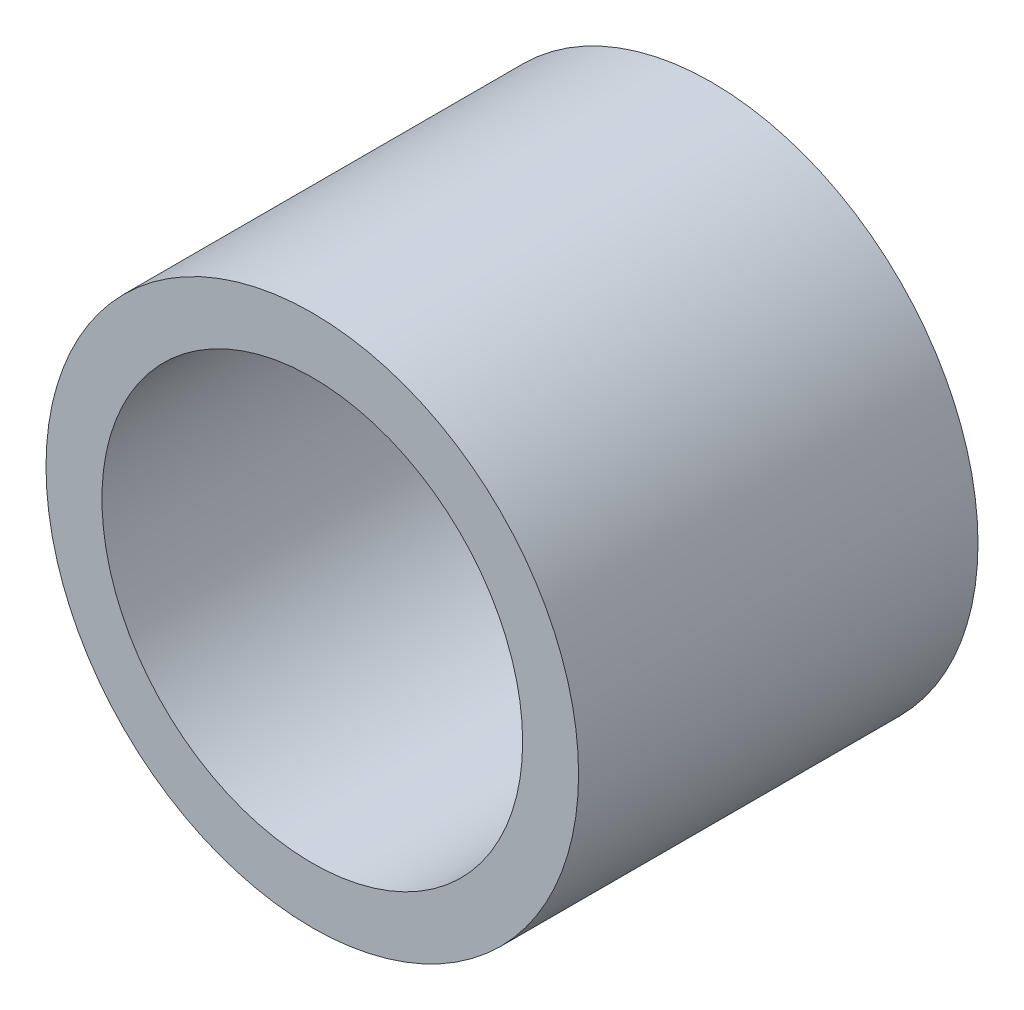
ISO-10303-21;
HEADER;
FILE_DESCRIPTION(('STEP AP214'),'2;1');
FILE_NAME('part.step','',(''),(''),'','','');
FILE_SCHEMA(('AUTOMOTIVE_DESIGN { 1 0 10303 214 1 1 1 1 }'));
ENDSEC;
DATA;
#1=APPLICATION_CONTEXT('core data for automotive mechanical design processes');
#2=APPLICATION_PROTOCOL_DEFINITION('international standard','automotive_design',2000,#1);
#3=PRODUCT_CONTEXT('',#1,'mechanical');
#4=PRODUCT('Part','Part','',(#3));
#5=PRODUCT_RELATED_PRODUCT_CATEGORY('part','',(#4));
#6=PRODUCT_DEFINITION_FORMATION('','',#4);
#7=PRODUCT_DEFINITION_CONTEXT('part definition',#1,'design');
#8=PRODUCT_DEFINITION('design','',#6,#7);
#9=PRODUCT_DEFINITION_SHAPE('','',#8);
#10=(LENGTH_UNIT() NAMED_UNIT(*) SI_UNIT(.MILLI.,.METRE.));
#11=(NAMED_UNIT(*) PLANE_ANGLE_UNIT() SI_UNIT($,.RADIAN.));
#12=(NAMED_UNIT(*) SI_UNIT($,.STERADIAN.) SOLID_ANGLE_UNIT());
#13=UNCERTAINTY_MEASURE_WITH_UNIT(LENGTH_MEASURE(1.E-05),#10,'distance_accuracy_value','');
#14=(GEOMETRIC_REPRESENTATION_CONTEXT(3) GLOBAL_UNCERTAINTY_ASSIGNED_CONTEXT((#13)) GLOBAL_UNIT_ASSIGNED_CONTEXT((#10,
#11,#12)) REPRESENTATION_CONTEXT('',''));
#15=CARTESIAN_POINT('',(0.,0.,0.));
#16=DIRECTION('',(0.,0.,1.));
#17=DIRECTION('',(1.,0.,0.));
#18=AXIS2_PLACEMENT_3D('',#15,#16,#17);
#19=CARTESIAN_POINT('',(0.,0.,15.));
#20=DIRECTION('',(0.,0.,1.));
#21=DIRECTION('',(1.,0.,0.));
#22=AXIS2_PLACEMENT_3D('',#19,#20,#21);
#23=PLANE('',#22);
#24=CARTESIAN_POINT('',(0.,0.,15.));
#25=DIRECTION('',(0.,0.,1.));
#26=DIRECTION('',(1.,0.,0.));
#27=AXIS2_PLACEMENT_3D('',#24,#25,#26);
#28=CIRCLE('',#27,10.);
#29=CARTESIAN_POINT('',(10.,0.,15.));
#30=VERTEX_POINT('',#29);
#31=EDGE_CURVE('E12',#30,#30,#28,.T.);
#32=ORIENTED_EDGE('',*,*,#31,.T.);
#33=EDGE_LOOP('',(#32));
#34=FACE_BOUND('',#33,.T.);
#35=CARTESIAN_POINT('',(0.,0.,15.));
#36=DIRECTION('',(0.,0.,1.));
#37=DIRECTION('',(1.,0.,0.));
#38=AXIS2_PLACEMENT_3D('',#35,#36,#37);
#39=CIRCLE('',#38,7.9);
#40=CARTESIAN_POINT('',(7.9,0.,15.));
#41=VERTEX_POINT('',#40);
#42=EDGE_CURVE('E55',#41,#41,#39,.T.);
#43=ORIENTED_EDGE('',*,*,#42,.F.);
#44=EDGE_LOOP('',(#43));
#45=FACE_BOUND('',#44,.T.);
#46=ADVANCED_FACE('F44',(#34,#45),#23,.T.);
#47=CARTESIAN_POINT('',(0.,0.,0.));
#48=DIRECTION('',(0.,0.,1.));
#49=DIRECTION('',(1.,0.,0.));
#50=AXIS2_PLACEMENT_3D('',#47,#48,#49);
#51=PLANE('',#50);
#52=CARTESIAN_POINT('',(0.,0.,0.));
#53=DIRECTION('',(0.,0.,1.));
#54=DIRECTION('',(1.,0.,0.));
#55=AXIS2_PLACEMENT_3D('',#52,#53,#54);
#56=CIRCLE('',#55,10.);
#57=CARTESIAN_POINT('',(10.,0.,0.));
#58=VERTEX_POINT('',#57);
#59=EDGE_CURVE('E48',#58,#58,#56,.T.);
#60=ORIENTED_EDGE('',*,*,#59,.F.);
#61=EDGE_LOOP('',(#60));
#62=FACE_BOUND('',#61,.T.);
#63=CARTESIAN_POINT('',(0.,0.,0.));
#64=DIRECTION('',(0.,0.,1.));
#65=DIRECTION('',(1.,0.,0.));
#66=AXIS2_PLACEMENT_3D('',#63,#64,#65);
#67=CIRCLE('',#66,7.9);
#68=CARTESIAN_POINT('',(7.9,0.,0.));
#69=VERTEX_POINT('',#68);
#70=EDGE_CURVE('E57',#69,#69,#67,.T.);
#71=ORIENTED_EDGE('',*,*,#70,.T.);
#72=EDGE_LOOP('',(#71));
#73=FACE_BOUND('',#72,.T.);
#74=ADVANCED_FACE('F67',(#62,#73),#51,.F.);
#75=CARTESIAN_POINT('',(0.,0.,15.));
#76=DIRECTION('',(0.,0.,-1.));
#77=DIRECTION('',(-1.,0.,0.));
#78=AXIS2_PLACEMENT_3D('',#75,#76,#77);
#79=CYLINDRICAL_SURFACE('',#78,10.);
#80=ORIENTED_EDGE('',*,*,#31,.F.);
#81=EDGE_LOOP('',(#80));
#82=FACE_BOUND('',#81,.T.);
#83=ORIENTED_EDGE('',*,*,#59,.T.);
#84=EDGE_LOOP('',(#83));
#85=FACE_BOUND('',#84,.T.);
#86=ADVANCED_FACE('F46',(#82,#85),#79,.T.);
#87=CARTESIAN_POINT('',(0.,0.,15.));
#88=DIRECTION('',(0.,0.,-1.));
#89=DIRECTION('',(-1.,0.,0.));
#90=AXIS2_PLACEMENT_3D('',#87,#88,#89);
#91=CYLINDRICAL_SURFACE('',#90,7.9);
#92=ORIENTED_EDGE('',*,*,#42,.T.);
#93=EDGE_LOOP('',(#92));
#94=FACE_BOUND('',#93,.T.);
#95=ORIENTED_EDGE('',*,*,#70,.F.);
#96=EDGE_LOOP('',(#95));
#97=FACE_BOUND('',#96,.T.);
#98=ADVANCED_FACE('F63',(#94,#97),#91,.F.);
#99=CLOSED_SHELL('',(#46,#74,#86,#98));
#100=MANIFOLD_SOLID_BREP('B2',#99);
#101=ADVANCED_BREP_SHAPE_REPRESENTATION('',(#18,#100),#14);
#102=SHAPE_DEFINITION_REPRESENTATION(#9,#101);
ENDSEC;
END-ISO-10303-21;
